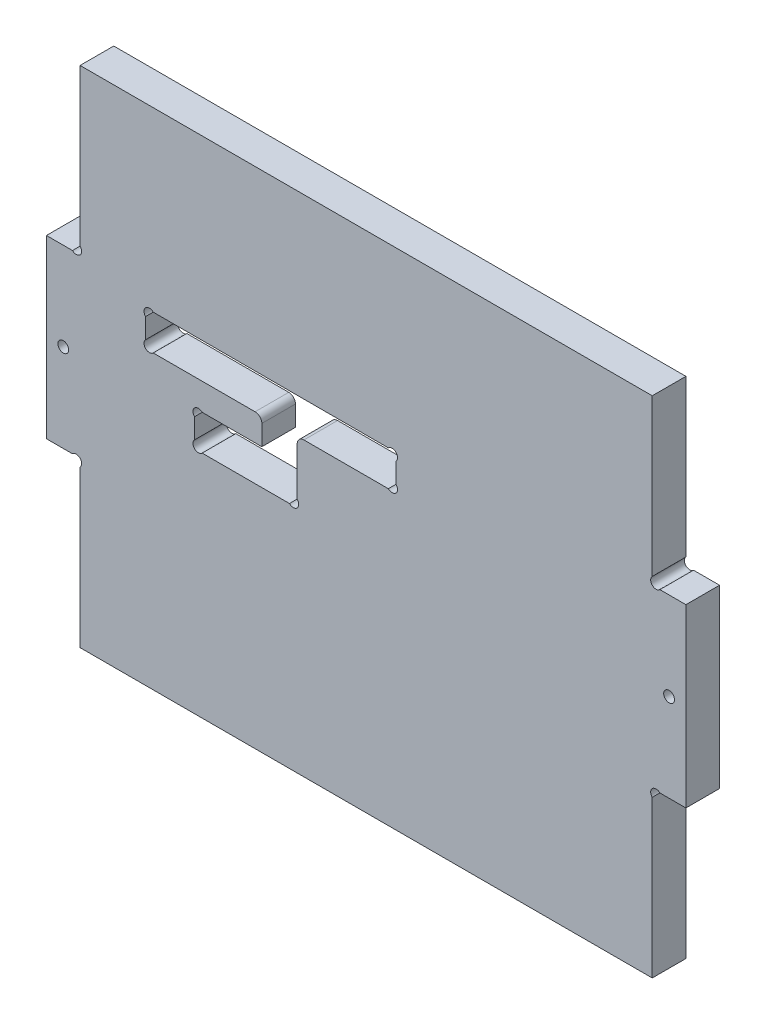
from build123d import *

# Parameters (mm, degrees)
BOSS_EXTRU_1_DEPTH       = 10
ENL_V_MAT_EXTRU_9_DEPTH  = 137.790533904
ENL_V_MAT_EXTRU_11_DEPTH = 137.790533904
ENL_V_MAT_EXTRU_12_DEPTH = 137.790533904
CONG_1_R                 = 2
ESQUISSE20_R             = 1.6
ENL_V_MAT_EXTRU_15_DEPTH = 137.790533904
ENL_V_MAT_EXTRU_16_DEPTH = 5


with BuildPart() as part:
    # Esquisse1 → Boss.-Extru.1 (new body)
    with BuildSketch(Plane.XY):
        Polygon((95, 41.907920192), (95, 51.907920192), (-95, 51.907920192), (-95, 41.907920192), (-95, -97.911440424), (95, -97.911440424), align=None)
        with BuildLine():
            Line((-31, -0.711440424), (-20.5, -0.711440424))
            Line((-20.5, -0.711440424), (-20.5, -27.478767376))
            ThreePointArc((-20.5, -27.478767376), (-20.52987147, -29.741311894), (-22.792415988, -29.711440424))
            Line((-22.792415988, -29.711440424), (-31, -29.711440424))
            Line((-31, -29.711440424), (-31, -0.711440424))
        make_face(mode=Mode.SUBTRACT)
    extrude(amount=BOSS_EXTRU_1_DEPTH)

    # Esquisse14 → Enl_v. mat.-Extru.9 (cut, through all)
    with BuildSketch(Plane.XY.offset(10)):
        with BuildLine():
            Line((85, 51.907920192), (85, 5.420661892))
            ThreePointArc((85, 5.420661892), (85, 3.157920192), (87.2627417, 3.157920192))
            Line((87.2627417, 3.157920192), (95, 3.157920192))
            Line((95, 3.157920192), (95, 51.907920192))
            Line((95, 51.907920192), (85, 51.907920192))
        make_face()
        with BuildLine():
            Line((-85, -97.911440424), (-85, -51.424182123))
            ThreePointArc((-85, -51.424182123), (-85, -49.161440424), (-87.2627417, -49.161440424))
            Line((-87.2627417, -49.161440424), (-95, -49.161440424))
            Line((-95, -49.161440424), (-95, -97.911440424))
            Line((-95, -97.911440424), (-85, -97.911440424))
        make_face()
        with BuildLine():
            Line((95, -97.911440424), (85, -97.911440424))
            Line((85, -97.911440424), (85, -51.424182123))
            ThreePointArc((85, -51.424182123), (85, -49.161440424), (87.2627417, -49.161440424))
            Line((87.2627417, -49.161440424), (95, -49.161440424))
            Line((95, -49.161440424), (95, -97.911440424))
        make_face()
        with BuildLine():
            Line((-95, 51.907920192), (-85, 51.907920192))
            Line((-85, 51.907920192), (-85, 5.420661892))
            ThreePointArc((-85, 5.420661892), (-85, 3.157920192), (-87.2627417, 3.157920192))
            Line((-87.2627417, 3.157920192), (-95, 3.157920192))
            Line((-95, 3.157920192), (-95, 51.907920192))
        make_face()
    extrude(amount=-ENL_V_MAT_EXTRU_9_DEPTH, mode=Mode.SUBTRACT)

    # Esquisse16 → Enl_v. mat.-Extru.11 (cut, through all)
    with BuildSketch(Plane.XY.offset(10)):
        with BuildLine():
            Line((-58.279304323, -0.711440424), (-63.2772583, -0.711440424))
            ThreePointArc((-63.2772583, -0.711440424), (-65.54, -0.711440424), (-65.54, -2.974182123))
            Line((-65.54, -2.974182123), (-65.54, -8.948698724))
            ThreePointArc((-65.54, -8.948698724), (-65.54, -11.211440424), (-63.2772583, -11.211440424))
            Line((-63.2772583, -11.211440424), (-58.279304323, -11.211440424))
            Line((-58.279304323, -11.211440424), (-31, -11.211440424))
            Line((-31, -11.211440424), (-31, -0.711440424))
            Line((-31, -0.711440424), (-58.279304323, -0.711440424))
        make_face()
        with BuildLine():
            Line((-20.5, -0.711440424), (6.583298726, -0.711440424))
            ThreePointArc((6.583298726, -0.711440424), (8.846032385, -0.717472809), (8.84, -2.980206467))
            Line((8.84, -2.980206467), (8.84, -8.94267438))
            ThreePointArc((8.84, -8.94267438), (8.846032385, -11.205408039), (6.583298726, -11.211440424))
            Line((6.583298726, -11.211440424), (-20.5, -11.211440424))
            Line((-20.5, -11.211440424), (-20.5, -0.711440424))
        make_face()
    extrude(amount=-ENL_V_MAT_EXTRU_11_DEPTH, mode=Mode.SUBTRACT)

    # Esquisse17 → Enl_v. mat.-Extru.12 (cut, through all)
    with BuildSketch(Plane.XY.offset(10)):
        with BuildLine():
            Line((-31, -29.711440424), (-48.739460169, -29.711440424))
            ThreePointArc((-48.739460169, -29.711440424), (-51.002200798, -29.709239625), (-51, -27.446498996))
            Line((-51, -27.446498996), (-51, -21.476381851))
            ThreePointArc((-51, -21.476381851), (-51.002200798, -19.213641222), (-48.739460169, -19.211440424))
            Line((-48.739460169, -19.211440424), (-31, -19.211440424))
            Line((-31, -19.211440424), (-31, -29.711440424))
        make_face()
    extrude(amount=-ENL_V_MAT_EXTRU_12_DEPTH, mode=Mode.SUBTRACT)

    # Cong_1
    cong_1_edges = [part.edges().sort_by_distance(p)[0] for p in [
        (-31, -11.211440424, 5),
        (-20.5, -11.211440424, 5),
    ]]
    fillet(cong_1_edges, radius=CONG_1_R)

    # Esquisse20 → Enl_v. mat.-Extru.15 (cut, through all)
    with BuildSketch(Plane(origin=(0, 0, 0), x_dir=(-1, 0, 0), z_dir=(0, 0, -1))):
        with Locations((-90, -23.001440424)):
            Circle(ESQUISSE20_R)
        with Locations(Location((90, -23.001440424, 0), (0, 0, 180))):
            Circle(ESQUISSE20_R)
    extrude(amount=-ENL_V_MAT_EXTRU_15_DEPTH, mode=Mode.SUBTRACT)

    # Esquisse21 → Enl_v. mat.-Extru.16 (cut)
    with BuildSketch(Plane(origin=(0, 0, 0), x_dir=(-1, 0, 0), z_dir=(0, 0, -1))):
        with BuildLine():
            Line((3.264461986, -66.729354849), (8.736435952, -66.729354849))
            ThreePointArc((8.736435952, -66.729354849), (10.999176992, -66.72762616), (11.000905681, -68.990367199))
            Line((11.000905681, -68.990367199), (11.000905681, -90.651481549))
            ThreePointArc((11.000905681, -90.651481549), (10.999176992, -92.914222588), (8.736435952, -92.912493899))
            Line((8.736435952, -92.912493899), (3.264461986, -92.912493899))
            ThreePointArc((3.264461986, -92.912493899), (1.001720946, -92.914222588), (0.999992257, -90.651481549))
            Line((0.999992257, -90.651481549), (0.999992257, -68.990367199))
            ThreePointArc((0.999992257, -68.990367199), (1.001720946, -66.72762616), (3.264461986, -66.729354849))
        make_face()
    extrude(amount=-ENL_V_MAT_EXTRU_16_DEPTH, mode=Mode.SUBTRACT)


solid = part.part
